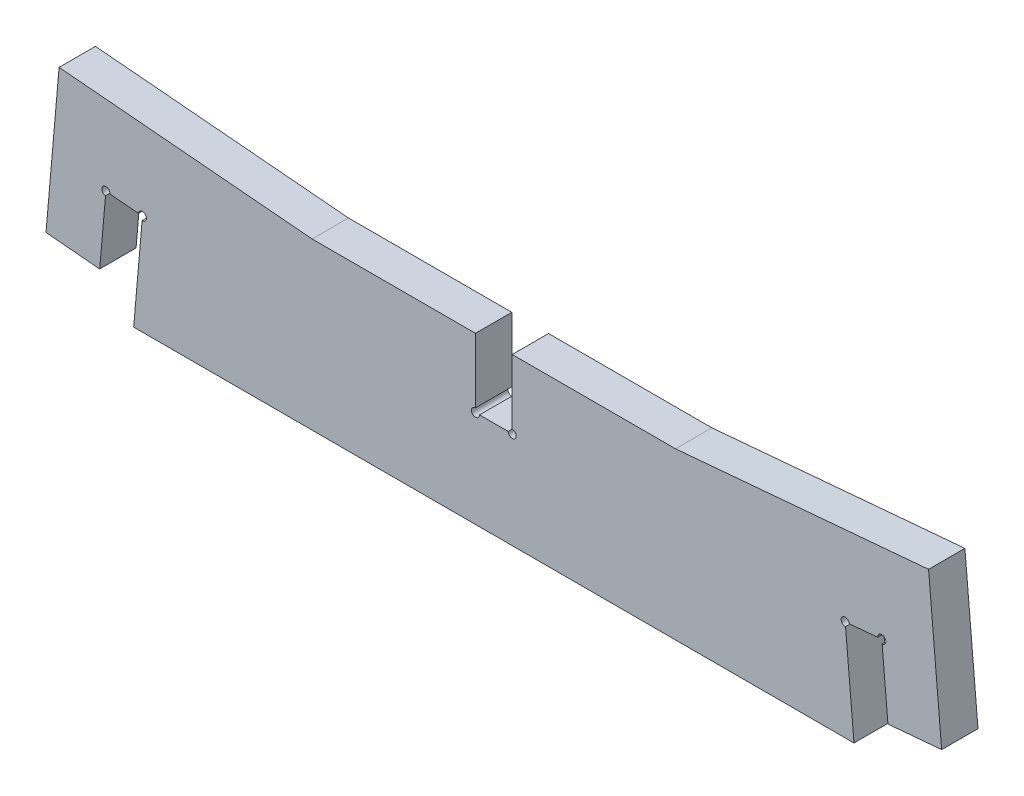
from build123d import *

# Parameters (mm, degrees)
BOSS_EXTRUDE1_DEPTH     = 18
CUT_EXTRUDE1_DEPTH      = 242.171630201
CUT_EXTRUDE1_DEPTH_BACK = 242.171630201
SKETCH2_W               = 18.2
SKETCH2_H               = 34
CUT_EXTRUDE2_REACH      = 243.172
SKETCH3_R               = 2


with BuildPart() as part:
    # Sketch1 → Boss-Extrude1 (new body)
    with BuildSketch(Plane.XY):
        Polygon((-178.383095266, 0), (178.383095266, 0), (174.025308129, 49.809734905), (192.156051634, 51.395969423), (195.20650263, 16.529154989), (221.804901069, 18.856213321), (215.32129302, 92.964192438), (90, 82), (-90, 82), (-215.32129302, 92.964192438), (-221.804901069, 18.856213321), (-195.20650263, 16.529154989), (-192.156051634, 51.395969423), (-174.025308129, 49.809734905), align=None)
    extrude(amount=BOSS_EXTRUDE1_DEPTH)

    # Sketch2 → Cut-Extrude1 (cut, two sides: drawn at the far end of the back side and taken through both)
    with BuildSketch(Plane.XY.offset(18).offset(-CUT_EXTRUDE1_DEPTH_BACK)):
        with Locations((0, 65)):
            Rectangle(SKETCH2_W, SKETCH2_H)
    extrude(amount=CUT_EXTRUDE1_DEPTH + CUT_EXTRUDE1_DEPTH_BACK, mode=Mode.SUBTRACT)

    # Sketch3 → Cut-Extrude2 (cut, up to next)
    with BuildSketch(Plane.XY.offset(18), mode=Mode.PRIVATE) as cut_extrude2_sk1:
        with Locations((192.156051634, 51.395969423)):
            Circle(SKETCH3_R)
    cut_extrude2_tool1 = extrude(cut_extrude2_sk1.sketch, amount=-CUT_EXTRUDE2_REACH, mode=Mode.PRIVATE) & part.part
    # Sketch3 → Cut-Extrude2 (cut, up to next)
    with BuildSketch(Plane.XY.offset(18), mode=Mode.PRIVATE) as cut_extrude2_sk2:
        with Locations((174.025308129, 49.809734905)):
            Circle(SKETCH3_R)
    cut_extrude2_tool2 = extrude(cut_extrude2_sk2.sketch, amount=-CUT_EXTRUDE2_REACH, mode=Mode.PRIVATE) & part.part
    # Sketch3 → Cut-Extrude2 (cut, up to next)
    with BuildSketch(Plane.XY.offset(18), mode=Mode.PRIVATE) as cut_extrude2_sk3:
        with Locations((9.1, 48)):
            Circle(SKETCH3_R)
    cut_extrude2_tool3 = extrude(cut_extrude2_sk3.sketch, amount=-CUT_EXTRUDE2_REACH, mode=Mode.PRIVATE) & part.part
    # Sketch3 → Cut-Extrude2 (cut, up to next)
    with BuildSketch(Plane.XY.offset(18), mode=Mode.PRIVATE) as cut_extrude2_sk4:
        with Locations((-9.1, 48)):
            Circle(SKETCH3_R)
    cut_extrude2_tool4 = extrude(cut_extrude2_sk4.sketch, amount=-CUT_EXTRUDE2_REACH, mode=Mode.PRIVATE) & part.part
    # Sketch3 → Cut-Extrude2 (cut, up to next)
    with BuildSketch(Plane.XY.offset(18), mode=Mode.PRIVATE) as cut_extrude2_sk5:
        with Locations((-174.025308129, 49.809734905)):
            Circle(SKETCH3_R)
    cut_extrude2_tool5 = extrude(cut_extrude2_sk5.sketch, amount=-CUT_EXTRUDE2_REACH, mode=Mode.PRIVATE) & part.part
    # Sketch3 → Cut-Extrude2 (cut, up to next)
    with BuildSketch(Plane.XY.offset(18), mode=Mode.PRIVATE) as cut_extrude2_sk6:
        with Locations((-192.156051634, 51.395969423)):
            Circle(SKETCH3_R)
    cut_extrude2_tool6 = extrude(cut_extrude2_sk6.sketch, amount=-CUT_EXTRUDE2_REACH, mode=Mode.PRIVATE) & part.part
    add(cut_extrude2_tool1.solids().sort_by_distance((192.156052, 51.395969, 18))[0], mode=Mode.SUBTRACT)
    add(cut_extrude2_tool2.solids().sort_by_distance((174.025308, 49.809735, 18))[0], mode=Mode.SUBTRACT)
    add(cut_extrude2_tool3.solids().sort_by_distance((9.1, 48, 18))[0], mode=Mode.SUBTRACT)
    add(cut_extrude2_tool4.solids().sort_by_distance((-9.1, 48, 18))[0], mode=Mode.SUBTRACT)
    add(cut_extrude2_tool5.solids().sort_by_distance((-174.025308, 49.809735, 18))[0], mode=Mode.SUBTRACT)
    add(cut_extrude2_tool6.solids().sort_by_distance((-192.156052, 51.395969, 18))[0], mode=Mode.SUBTRACT)


solid = part.part
